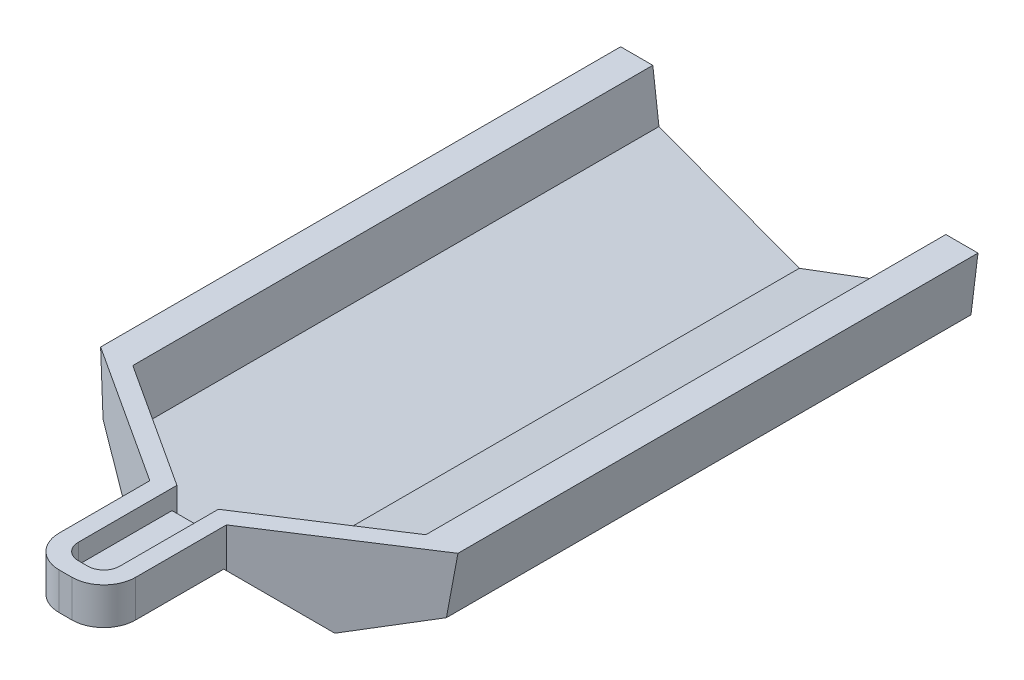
ISO-10303-21;
HEADER;
FILE_DESCRIPTION(('STEP AP214'),'2;1');
FILE_NAME('part.step','',(''),(''),'','','');
FILE_SCHEMA(('AUTOMOTIVE_DESIGN { 1 0 10303 214 1 1 1 1 }'));
ENDSEC;
DATA;
#1=APPLICATION_CONTEXT('core data for automotive mechanical design processes');
#2=APPLICATION_PROTOCOL_DEFINITION('international standard','automotive_design',2000,#1);
#3=PRODUCT_CONTEXT('',#1,'mechanical');
#4=PRODUCT('Part','Part','',(#3));
#5=PRODUCT_RELATED_PRODUCT_CATEGORY('part','',(#4));
#6=PRODUCT_DEFINITION_FORMATION('','',#4);
#7=PRODUCT_DEFINITION_CONTEXT('part definition',#1,'design');
#8=PRODUCT_DEFINITION('design','',#6,#7);
#9=PRODUCT_DEFINITION_SHAPE('','',#8);
#10=(LENGTH_UNIT() NAMED_UNIT(*) SI_UNIT(.MILLI.,.METRE.));
#11=(NAMED_UNIT(*) PLANE_ANGLE_UNIT() SI_UNIT($,.RADIAN.));
#12=(NAMED_UNIT(*) SI_UNIT($,.STERADIAN.) SOLID_ANGLE_UNIT());
#13=UNCERTAINTY_MEASURE_WITH_UNIT(LENGTH_MEASURE(1.E-05),#10,'distance_accuracy_value','');
#14=(GEOMETRIC_REPRESENTATION_CONTEXT(3) GLOBAL_UNCERTAINTY_ASSIGNED_CONTEXT((#13)) GLOBAL_UNIT_ASSIGNED_CONTEXT((#10,
#11,#12)) REPRESENTATION_CONTEXT('',''));
#15=CARTESIAN_POINT('',(0.,0.,0.));
#16=DIRECTION('',(0.,0.,1.));
#17=DIRECTION('',(1.,0.,0.));
#18=AXIS2_PLACEMENT_3D('',#15,#16,#17);
#19=CARTESIAN_POINT('',(-53.8063518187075,20.1341692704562,230.));
#20=DIRECTION('',(0.992546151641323,0.121869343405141,0.));
#21=DIRECTION('',(-0.121869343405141,0.992546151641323,0.));
#22=AXIS2_PLACEMENT_3D('',#19,#20,#21);
#23=PLANE('',#22);
#24=DIRECTION('',(0.,0.,-1.));
#25=VECTOR('',#24,1.);
#26=CARTESIAN_POINT('',(-53.8063518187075,20.1341692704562,230.));
#27=LINE('',#26,#25);
#28=CARTESIAN_POINT('',(-53.8063518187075,20.1341692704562,164.424571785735));
#29=VERTEX_POINT('',#28);
#30=CARTESIAN_POINT('',(-53.8063518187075,20.1341692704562,0.));
#31=VERTEX_POINT('',#30);
#32=EDGE_CURVE('E367',#29,#31,#27,.T.);
#33=ORIENTED_EDGE('',*,*,#32,.F.);
#34=DIRECTION('',(-0.121489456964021,0.989452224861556,-0.0788961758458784));
#35=VECTOR('',#34,1.);
#36=CARTESIAN_POINT('',(-53.1778078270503,15.0150892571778,164.832753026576));
#37=LINE('',#36,#35);
#38=CARTESIAN_POINT('',(-56.,38.,163.));
#39=VERTEX_POINT('',#38);
#40=EDGE_CURVE('E338',#29,#39,#37,.T.);
#41=ORIENTED_EDGE('',*,*,#40,.T.);
#42=DIRECTION('',(0.,0.,-1.));
#43=VECTOR('',#42,1.);
#44=CARTESIAN_POINT('',(-56.,38.,230.));
#45=LINE('',#44,#43);
#46=CARTESIAN_POINT('',(-56.,38.,0.));
#47=VERTEX_POINT('',#46);
#48=EDGE_CURVE('E358',#39,#47,#45,.T.);
#49=ORIENTED_EDGE('',*,*,#48,.T.);
#50=DIRECTION('',(0.121869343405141,-0.992546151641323,0.));
#51=VECTOR('',#50,1.);
#52=CARTESIAN_POINT('',(-53.8063518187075,20.1341692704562,0.));
#53=LINE('',#52,#51);
#54=EDGE_CURVE('E341',#47,#31,#53,.T.);
#55=ORIENTED_EDGE('',*,*,#54,.T.);
#56=EDGE_LOOP('',(#33,#41,#49,#55));
#57=FACE_BOUND('',#56,.T.);
#58=ADVANCED_FACE('F31',(#57),#23,.F.);
#59=CARTESIAN_POINT('',(0.,0.,230.));
#60=DIRECTION('',(0.350463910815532,0.936576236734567,0.));
#61=DIRECTION('',(-0.936576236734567,0.350463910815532,0.));
#62=AXIS2_PLACEMENT_3D('',#59,#60,#61);
#63=PLANE('',#62);
#64=DIRECTION('',(0.,0.,-1.));
#65=VECTOR('',#64,1.);
#66=CARTESIAN_POINT('',(0.,0.,230.));
#67=LINE('',#66,#65);
#68=CARTESIAN_POINT('',(0.,0.,166.));
#69=VERTEX_POINT('',#68);
#70=CARTESIAN_POINT('',(0.,0.,0.));
#71=VERTEX_POINT('',#70);
#72=EDGE_CURVE('E365',#69,#71,#67,.T.);
#73=ORIENTED_EDGE('',*,*,#72,.F.);
#74=DIRECTION('',(-0.88386738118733,0.330740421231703,0.330740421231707));
#75=VECTOR('',#74,1.);
#76=CARTESIAN_POINT('',(-18.7091628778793,7.00091047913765,173.000910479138));
#77=LINE('',#76,#75);
#78=CARTESIAN_POINT('',(-32.5973810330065,12.1978384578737,178.197838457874));
#79=VERTEX_POINT('',#78);
#80=EDGE_CURVE('E303',#69,#79,#77,.T.);
#81=ORIENTED_EDGE('',*,*,#80,.T.);
#82=DIRECTION('',(-0.800191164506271,0.299429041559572,-0.519650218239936));
#83=VECTOR('',#82,1.);
#84=CARTESIAN_POINT('',(12.7378718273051,-4.76647196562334,207.63889590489));
#85=LINE('',#84,#83);
#86=EDGE_CURVE('E336',#79,#29,#85,.T.);
#87=ORIENTED_EDGE('',*,*,#86,.T.);
#88=ORIENTED_EDGE('',*,*,#32,.T.);
#89=DIRECTION('',(0.936576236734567,-0.350463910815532,0.));
#90=VECTOR('',#89,1.);
#91=CARTESIAN_POINT('',(0.,0.,0.));
#92=LINE('',#91,#90);
#93=EDGE_CURVE('E344',#31,#71,#92,.T.);
#94=ORIENTED_EDGE('',*,*,#93,.T.);
#95=EDGE_LOOP('',(#73,#81,#87,#88,#94));
#96=FACE_BOUND('',#95,.T.);
#97=ADVANCED_FACE('F428',(#96),#63,.F.);
#98=CARTESIAN_POINT('',(0.,0.,230.));
#99=DIRECTION('',(-0.350463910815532,0.936576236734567,0.));
#100=DIRECTION('',(-0.936576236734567,-0.350463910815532,0.));
#101=AXIS2_PLACEMENT_3D('',#98,#99,#100);
#102=PLANE('',#101);
#103=DIRECTION('',(-0.800191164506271,-0.299429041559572,0.519650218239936));
#104=VECTOR('',#103,1.);
#105=CARTESIAN_POINT('',(-12.7378718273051,-4.76647196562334,207.63889590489));
#106=LINE('',#105,#104);
#107=CARTESIAN_POINT('',(53.8063518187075,20.1341692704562,164.424571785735));
#108=VERTEX_POINT('',#107);
#109=CARTESIAN_POINT('',(32.5973810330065,12.1978384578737,178.197838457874));
#110=VERTEX_POINT('',#109);
#111=EDGE_CURVE('E326',#108,#110,#106,.T.);
#112=ORIENTED_EDGE('',*,*,#111,.T.);
#113=DIRECTION('',(-0.88386738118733,-0.330740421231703,-0.330740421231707));
#114=VECTOR('',#113,1.);
#115=CARTESIAN_POINT('',(18.7091628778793,7.00091047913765,173.000910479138));
#116=LINE('',#115,#114);
#117=EDGE_CURVE('E300',#110,#69,#116,.T.);
#118=ORIENTED_EDGE('',*,*,#117,.T.);
#119=ORIENTED_EDGE('',*,*,#72,.T.);
#120=DIRECTION('',(0.936576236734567,0.350463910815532,0.));
#121=VECTOR('',#120,1.);
#122=CARTESIAN_POINT('',(0.,0.,0.));
#123=LINE('',#122,#121);
#124=CARTESIAN_POINT('',(53.8063518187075,20.1341692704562,0.));
#125=VERTEX_POINT('',#124);
#126=EDGE_CURVE('E347',#71,#125,#123,.T.);
#127=ORIENTED_EDGE('',*,*,#126,.T.);
#128=DIRECTION('',(0.,0.,-1.));
#129=VECTOR('',#128,1.);
#130=CARTESIAN_POINT('',(53.8063518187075,20.1341692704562,230.));
#131=LINE('',#130,#129);
#132=EDGE_CURVE('E363',#108,#125,#131,.T.);
#133=ORIENTED_EDGE('',*,*,#132,.F.);
#134=EDGE_LOOP('',(#112,#118,#119,#127,#133));
#135=FACE_BOUND('',#134,.T.);
#136=ADVANCED_FACE('F433',(#135),#102,.F.);
#137=CARTESIAN_POINT('',(53.8063518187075,20.1341692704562,230.));
#138=DIRECTION('',(-0.992546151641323,0.121869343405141,0.));
#139=DIRECTION('',(-0.121869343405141,-0.992546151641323,0.));
#140=AXIS2_PLACEMENT_3D('',#137,#138,#139);
#141=PLANE('',#140);
#142=DIRECTION('',(0.,0.,-1.));
#143=VECTOR('',#142,1.);
#144=CARTESIAN_POINT('',(56.,38.,230.));
#145=LINE('',#144,#143);
#146=CARTESIAN_POINT('',(56.,38.,163.));
#147=VERTEX_POINT('',#146);
#148=CARTESIAN_POINT('',(56.,38.,0.));
#149=VERTEX_POINT('',#148);
#150=EDGE_CURVE('E361',#147,#149,#145,.T.);
#151=ORIENTED_EDGE('',*,*,#150,.F.);
#152=DIRECTION('',(-0.121489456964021,-0.989452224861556,0.0788961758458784));
#153=VECTOR('',#152,1.);
#154=CARTESIAN_POINT('',(53.1778078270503,15.0150892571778,164.832753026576));
#155=LINE('',#154,#153);
#156=EDGE_CURVE('E323',#147,#108,#155,.T.);
#157=ORIENTED_EDGE('',*,*,#156,.T.);
#158=ORIENTED_EDGE('',*,*,#132,.T.);
#159=DIRECTION('',(0.121869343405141,0.992546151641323,0.));
#160=VECTOR('',#159,1.);
#161=CARTESIAN_POINT('',(53.8063518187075,20.1341692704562,0.));
#162=LINE('',#161,#160);
#163=EDGE_CURVE('E350',#125,#149,#162,.T.);
#164=ORIENTED_EDGE('',*,*,#163,.T.);
#165=EDGE_LOOP('',(#151,#157,#158,#164));
#166=FACE_BOUND('',#165,.T.);
#167=ADVANCED_FACE('F474',(#166),#141,.F.);
#168=CARTESIAN_POINT('',(56.,38.,230.));
#169=DIRECTION('',(0.,-1.,0.));
#170=DIRECTION('',(0.,0.,-1.));
#171=AXIS2_PLACEMENT_3D('',#168,#169,#170);
#172=PLANE('',#171);
#173=DIRECTION('',(0.,0.,-1.));
#174=VECTOR('',#173,1.);
#175=CARTESIAN_POINT('',(-45.9249017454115,38.,230.));
#176=LINE('',#175,#174);
#177=CARTESIAN_POINT('',(-45.9249017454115,38.,162.984847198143));
#178=VERTEX_POINT('',#177);
#179=CARTESIAN_POINT('',(-45.9249017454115,38.,0.));
#180=VERTEX_POINT('',#179);
#181=EDGE_CURVE('E281',#178,#180,#176,.T.);
#182=ORIENTED_EDGE('',*,*,#181,.T.);
#183=DIRECTION('',(-1.,0.,0.));
#184=VECTOR('',#183,1.);
#185=CARTESIAN_POINT('',(56.,38.,0.));
#186=LINE('',#185,#184);
#187=EDGE_CURVE('E353',#180,#47,#186,.T.);
#188=ORIENTED_EDGE('',*,*,#187,.T.);
#189=ORIENTED_EDGE('',*,*,#48,.F.);
#190=DIRECTION('',(-0.838670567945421,0.,-0.544639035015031));
#191=VECTOR('',#190,1.);
#192=CARTESIAN_POINT('',(-12.,38.,191.573934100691));
#193=LINE('',#192,#191);
#194=CARTESIAN_POINT('',(-12.,38.,191.573934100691));
#195=VERTEX_POINT('',#194);
#196=EDGE_CURVE('E331',#195,#39,#193,.T.);
#197=ORIENTED_EDGE('',*,*,#196,.F.);
#198=DIRECTION('',(0.,0.,-1.));
#199=VECTOR('',#198,1.);
#200=CARTESIAN_POINT('',(-12.,38.,230.));
#201=LINE('',#200,#199);
#202=CARTESIAN_POINT('',(-12.,38.,220.));
#203=VERTEX_POINT('',#202);
#204=EDGE_CURVE('E329',#203,#195,#201,.T.);
#205=ORIENTED_EDGE('',*,*,#204,.F.);
#206=CARTESIAN_POINT('',(-2.,38.,220.));
#207=DIRECTION('',(0.,-1.,0.));
#208=DIRECTION('',(0.,0.,-1.));
#209=AXIS2_PLACEMENT_3D('',#206,#207,#208);
#210=CIRCLE('',#209,10.);
#211=CARTESIAN_POINT('',(-2.,38.,230.));
#212=VERTEX_POINT('',#211);
#213=EDGE_CURVE('E377',#203,#212,#210,.F.);
#214=ORIENTED_EDGE('',*,*,#213,.T.);
#215=DIRECTION('',(-1.,0.,0.));
#216=VECTOR('',#215,1.);
#217=CARTESIAN_POINT('',(56.,38.,230.));
#218=LINE('',#217,#216);
#219=CARTESIAN_POINT('',(2.,38.,230.));
#220=VERTEX_POINT('',#219);
#221=EDGE_CURVE('E356',#220,#212,#218,.T.);
#222=ORIENTED_EDGE('',*,*,#221,.F.);
#223=CARTESIAN_POINT('',(2.,38.,220.));
#224=DIRECTION('',(0.,-1.,0.));
#225=DIRECTION('',(0.,0.,-1.));
#226=AXIS2_PLACEMENT_3D('',#223,#224,#225);
#227=CIRCLE('',#226,10.);
#228=CARTESIAN_POINT('',(12.,38.,220.));
#229=VERTEX_POINT('',#228);
#230=EDGE_CURVE('E391',#220,#229,#227,.F.);
#231=ORIENTED_EDGE('',*,*,#230,.T.);
#232=DIRECTION('',(0.,0.,1.));
#233=VECTOR('',#232,1.);
#234=CARTESIAN_POINT('',(12.,38.,230.));
#235=LINE('',#234,#233);
#236=CARTESIAN_POINT('',(12.,38.,191.573934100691));
#237=VERTEX_POINT('',#236);
#238=EDGE_CURVE('E318',#237,#229,#235,.T.);
#239=ORIENTED_EDGE('',*,*,#238,.F.);
#240=DIRECTION('',(-0.838670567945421,0.,0.544639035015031));
#241=VECTOR('',#240,1.);
#242=CARTESIAN_POINT('',(12.,38.,191.573934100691));
#243=LINE('',#242,#241);
#244=EDGE_CURVE('E315',#147,#237,#243,.T.);
#245=ORIENTED_EDGE('',*,*,#244,.F.);
#246=ORIENTED_EDGE('',*,*,#150,.T.);
#247=CARTESIAN_POINT('',(45.9249017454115,38.,0.));
#248=VERTEX_POINT('',#247);
#249=EDGE_CURVE('E354',#149,#248,#186,.T.);
#250=ORIENTED_EDGE('',*,*,#249,.T.);
#251=DIRECTION('',(0.,0.,-1.));
#252=VECTOR('',#251,1.);
#253=CARTESIAN_POINT('',(45.9249017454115,38.,230.));
#254=LINE('',#253,#252);
#255=CARTESIAN_POINT('',(45.9249017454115,38.,162.984847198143));
#256=VERTEX_POINT('',#255);
#257=EDGE_CURVE('E213',#256,#248,#254,.T.);
#258=ORIENTED_EDGE('',*,*,#257,.F.);
#259=DIRECTION('',(-0.838670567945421,0.,0.544639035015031));
#260=VECTOR('',#259,1.);
#261=CARTESIAN_POINT('',(9.00448530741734,38.,186.961245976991));
#262=LINE('',#261,#260);
#263=CARTESIAN_POINT('',(6.50000000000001,38.,188.587677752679));
#264=VERTEX_POINT('',#263);
#265=EDGE_CURVE('E273',#256,#264,#262,.T.);
#266=ORIENTED_EDGE('',*,*,#265,.T.);
#267=DIRECTION('',(0.,0.,1.));
#268=VECTOR('',#267,1.);
#269=CARTESIAN_POINT('',(6.5,38.,230.));
#270=LINE('',#269,#268);
#271=CARTESIAN_POINT('',(6.5,38.,219.5));
#272=VERTEX_POINT('',#271);
#273=EDGE_CURVE('E260',#264,#272,#270,.T.);
#274=ORIENTED_EDGE('',*,*,#273,.T.);
#275=CARTESIAN_POINT('',(1.49999999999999,38.,219.5));
#276=DIRECTION('',(0.,-1.,0.));
#277=DIRECTION('',(0.,0.,-1.));
#278=AXIS2_PLACEMENT_3D('',#275,#276,#277);
#279=CIRCLE('',#278,5.);
#280=CARTESIAN_POINT('',(1.49999999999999,38.,224.5));
#281=VERTEX_POINT('',#280);
#282=EDGE_CURVE('E400',#272,#281,#279,.T.);
#283=ORIENTED_EDGE('',*,*,#282,.T.);
#284=DIRECTION('',(-1.,0.,0.));
#285=VECTOR('',#284,1.);
#286=CARTESIAN_POINT('',(56.,38.,224.5));
#287=LINE('',#286,#285);
#288=CARTESIAN_POINT('',(-1.49999999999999,38.,224.5));
#289=VERTEX_POINT('',#288);
#290=EDGE_CURVE('E241',#281,#289,#287,.T.);
#291=ORIENTED_EDGE('',*,*,#290,.T.);
#292=CARTESIAN_POINT('',(-1.49999999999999,38.,219.5));
#293=DIRECTION('',(0.,-1.,0.));
#294=DIRECTION('',(0.,0.,-1.));
#295=AXIS2_PLACEMENT_3D('',#292,#293,#294);
#296=CIRCLE('',#295,5.);
#297=CARTESIAN_POINT('',(-6.5,38.,219.5));
#298=VERTEX_POINT('',#297);
#299=EDGE_CURVE('E11',#289,#298,#296,.T.);
#300=ORIENTED_EDGE('',*,*,#299,.T.);
#301=DIRECTION('',(0.,0.,-1.));
#302=VECTOR('',#301,1.);
#303=CARTESIAN_POINT('',(-6.5,38.,230.));
#304=LINE('',#303,#302);
#305=CARTESIAN_POINT('',(-6.50000000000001,38.,188.587677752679));
#306=VERTEX_POINT('',#305);
#307=EDGE_CURVE('E252',#298,#306,#304,.T.);
#308=ORIENTED_EDGE('',*,*,#307,.T.);
#309=DIRECTION('',(-0.838670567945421,0.,-0.544639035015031));
#310=VECTOR('',#309,1.);
#311=CARTESIAN_POINT('',(-9.00448530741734,38.,186.961245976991));
#312=LINE('',#311,#310);
#313=EDGE_CURVE('E276',#306,#178,#312,.T.);
#314=ORIENTED_EDGE('',*,*,#313,.T.);
#315=EDGE_LOOP('',(#182,#188,#189,#197,#205,#214,#222,#231,#239,#245,#246,#250,#258,#266,#274,
#283,#291,#300,#308,#314));
#316=FACE_BOUND('',#315,.T.);
#317=ADVANCED_FACE('F452',(#316),#172,.F.);
#318=CARTESIAN_POINT('',(-56.,38.,230.));
#319=DIRECTION('',(0.,0.,1.));
#320=DIRECTION('',(1.,0.,0.));
#321=AXIS2_PLACEMENT_3D('',#318,#319,#320);
#322=PLANE('',#321);
#323=DIRECTION('',(1.,0.,0.));
#324=VECTOR('',#323,1.);
#325=CARTESIAN_POINT('',(-50.,26.39701808,230.));
#326=LINE('',#325,#324);
#327=CARTESIAN_POINT('',(-2.,26.39701808,230.));
#328=VERTEX_POINT('',#327);
#329=CARTESIAN_POINT('',(2.,26.39701808,230.));
#330=VERTEX_POINT('',#329);
#331=EDGE_CURVE('E265',#328,#330,#326,.T.);
#332=ORIENTED_EDGE('',*,*,#331,.T.);
#333=DIRECTION('',(0.,-1.,0.));
#334=VECTOR('',#333,1.);
#335=CARTESIAN_POINT('',(2.,38.,230.));
#336=LINE('',#335,#334);
#337=EDGE_CURVE('E389',#330,#220,#336,.F.);
#338=ORIENTED_EDGE('',*,*,#337,.T.);
#339=ORIENTED_EDGE('',*,*,#221,.T.);
#340=DIRECTION('',(0.,1.,0.));
#341=VECTOR('',#340,1.);
#342=CARTESIAN_POINT('',(-2.,26.39701808,230.));
#343=LINE('',#342,#341);
#344=EDGE_CURVE('E380',#212,#328,#343,.F.);
#345=ORIENTED_EDGE('',*,*,#344,.T.);
#346=EDGE_LOOP('',(#332,#338,#339,#345));
#347=FACE_BOUND('',#346,.T.);
#348=ADVANCED_FACE('F500',(#347),#322,.T.);
#349=CARTESIAN_POINT('',(-56.,38.,0.));
#350=DIRECTION('',(0.,0.,1.));
#351=DIRECTION('',(1.,0.,0.));
#352=AXIS2_PLACEMENT_3D('',#349,#350,#351);
#353=PLANE('',#352);
#354=ORIENTED_EDGE('',*,*,#187,.F.);
#355=DIRECTION('',(0.121869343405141,-0.992546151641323,0.));
#356=VECTOR('',#355,1.);
#357=CARTESIAN_POINT('',(-46.0745384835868,39.2186934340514,0.));
#358=LINE('',#357,#356);
#359=CARTESIAN_POINT('',(-44.0018252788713,22.3377990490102,0.));
#360=VERTEX_POINT('',#359);
#361=EDGE_CURVE('E222',#180,#360,#358,.T.);
#362=ORIENTED_EDGE('',*,*,#361,.T.);
#363=DIRECTION('',(0.936576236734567,-0.350463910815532,0.));
#364=VECTOR('',#363,1.);
#365=CARTESIAN_POINT('',(-59.6672256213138,28.1997430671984,0.));
#366=LINE('',#365,#364);
#367=CARTESIAN_POINT('',(0.,5.87245307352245,0.));
#368=VERTEX_POINT('',#367);
#369=EDGE_CURVE('E228',#360,#368,#366,.T.);
#370=ORIENTED_EDGE('',*,*,#369,.T.);
#371=DIRECTION('',(0.936576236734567,0.350463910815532,0.));
#372=VECTOR('',#371,1.);
#373=CARTESIAN_POINT('',(-38.5763796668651,-8.56270805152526,0.));
#374=LINE('',#373,#372);
#375=CARTESIAN_POINT('',(44.0018252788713,22.3377990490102,0.));
#376=VERTEX_POINT('',#375);
#377=EDGE_CURVE('E206',#368,#376,#374,.T.);
#378=ORIENTED_EDGE('',*,*,#377,.T.);
#379=DIRECTION('',(0.121869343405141,0.992546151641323,0.));
#380=VECTOR('',#379,1.);
#381=CARTESIAN_POINT('',(44.4110991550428,25.6710672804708,0.));
#382=LINE('',#381,#380);
#383=EDGE_CURVE('E216',#376,#248,#382,.T.);
#384=ORIENTED_EDGE('',*,*,#383,.T.);
#385=ORIENTED_EDGE('',*,*,#249,.F.);
#386=ORIENTED_EDGE('',*,*,#163,.F.);
#387=ORIENTED_EDGE('',*,*,#126,.F.);
#388=ORIENTED_EDGE('',*,*,#93,.F.);
#389=ORIENTED_EDGE('',*,*,#54,.F.);
#390=EDGE_LOOP('',(#354,#362,#370,#378,#384,#385,#386,#387,#388,#389));
#391=FACE_BOUND('',#390,.T.);
#392=ADVANCED_FACE('F225',(#391),#353,.F.);
#393=CARTESIAN_POINT('',(-12.,0.,191.573934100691));
#394=DIRECTION('',(0.544639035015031,0.,-0.838670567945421));
#395=DIRECTION('',(-0.838670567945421,0.,-0.544639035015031));
#396=AXIS2_PLACEMENT_3D('',#393,#394,#395);
#397=PLANE('',#396);
#398=ORIENTED_EDGE('',*,*,#86,.F.);
#399=DIRECTION('',(0.73651753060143,0.478300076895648,0.478300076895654));
#400=VECTOR('',#399,1.);
#401=CARTESIAN_POINT('',(-21.0090932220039,19.7233605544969,185.723360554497));
#402=LINE('',#401,#400);
#403=CARTESIAN_POINT('',(-12.,25.5739341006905,191.573934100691));
#404=VERTEX_POINT('',#403);
#405=EDGE_CURVE('E306',#79,#404,#402,.T.);
#406=ORIENTED_EDGE('',*,*,#405,.T.);
#407=DIRECTION('',(0.,1.,0.));
#408=VECTOR('',#407,1.);
#409=CARTESIAN_POINT('',(-12.,0.,191.573934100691));
#410=LINE('',#409,#408);
#411=EDGE_CURVE('E333',#404,#195,#410,.T.);
#412=ORIENTED_EDGE('',*,*,#411,.T.);
#413=ORIENTED_EDGE('',*,*,#196,.T.);
#414=ORIENTED_EDGE('',*,*,#40,.F.);
#415=EDGE_LOOP('',(#398,#406,#412,#413,#414));
#416=FACE_BOUND('',#415,.T.);
#417=ADVANCED_FACE('F448',(#416),#397,.F.);
#418=CARTESIAN_POINT('',(-12.,0.,230.));
#419=DIRECTION('',(1.,0.,0.));
#420=DIRECTION('',(0.,0.,-1.));
#421=AXIS2_PLACEMENT_3D('',#418,#419,#420);
#422=PLANE('',#421);
#423=DIRECTION('',(0.,0.,1.));
#424=VECTOR('',#423,1.);
#425=CARTESIAN_POINT('',(-12.,26.39701808,230.));
#426=LINE('',#425,#424);
#427=CARTESIAN_POINT('',(-12.,26.39701808,192.39701808));
#428=VERTEX_POINT('',#427);
#429=CARTESIAN_POINT('',(-12.,26.39701808,220.));
#430=VERTEX_POINT('',#429);
#431=EDGE_CURVE('E312',#428,#430,#426,.T.);
#432=ORIENTED_EDGE('',*,*,#431,.T.);
#433=DIRECTION('',(0.,1.,0.));
#434=VECTOR('',#433,1.);
#435=CARTESIAN_POINT('',(-12.,38.,220.));
#436=LINE('',#435,#434);
#437=EDGE_CURVE('E374',#430,#203,#436,.T.);
#438=ORIENTED_EDGE('',*,*,#437,.T.);
#439=ORIENTED_EDGE('',*,*,#204,.T.);
#440=ORIENTED_EDGE('',*,*,#411,.F.);
#441=DIRECTION('',(0.,0.707106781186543,0.707106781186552));
#442=VECTOR('',#441,1.);
#443=CARTESIAN_POINT('',(-12.,32.,198.));
#444=LINE('',#443,#442);
#445=EDGE_CURVE('E309',#404,#428,#444,.T.);
#446=ORIENTED_EDGE('',*,*,#445,.T.);
#447=EDGE_LOOP('',(#432,#438,#439,#440,#446));
#448=FACE_BOUND('',#447,.T.);
#449=ADVANCED_FACE('F489',(#448),#422,.F.);
#450=CARTESIAN_POINT('',(12.,0.,191.573934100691));
#451=DIRECTION('',(-0.544639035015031,0.,-0.838670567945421));
#452=DIRECTION('',(-0.838670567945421,0.,0.544639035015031));
#453=AXIS2_PLACEMENT_3D('',#450,#451,#452);
#454=PLANE('',#453);
#455=DIRECTION('',(0.,1.,0.));
#456=VECTOR('',#455,1.);
#457=CARTESIAN_POINT('',(12.,0.,191.573934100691));
#458=LINE('',#457,#456);
#459=CARTESIAN_POINT('',(12.,25.5739341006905,191.573934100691));
#460=VERTEX_POINT('',#459);
#461=EDGE_CURVE('E321',#460,#237,#458,.T.);
#462=ORIENTED_EDGE('',*,*,#461,.F.);
#463=DIRECTION('',(0.73651753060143,-0.478300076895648,-0.478300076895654));
#464=VECTOR('',#463,1.);
#465=CARTESIAN_POINT('',(21.0090932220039,19.7233605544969,185.723360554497));
#466=LINE('',#465,#464);
#467=EDGE_CURVE('E295',#460,#110,#466,.T.);
#468=ORIENTED_EDGE('',*,*,#467,.T.);
#469=ORIENTED_EDGE('',*,*,#111,.F.);
#470=ORIENTED_EDGE('',*,*,#156,.F.);
#471=ORIENTED_EDGE('',*,*,#244,.T.);
#472=EDGE_LOOP('',(#462,#468,#469,#470,#471));
#473=FACE_BOUND('',#472,.T.);
#474=ADVANCED_FACE('F477',(#473),#454,.F.);
#475=CARTESIAN_POINT('',(12.,0.,230.));
#476=DIRECTION('',(-1.,0.,0.));
#477=DIRECTION('',(0.,0.,1.));
#478=AXIS2_PLACEMENT_3D('',#475,#476,#477);
#479=PLANE('',#478);
#480=ORIENTED_EDGE('',*,*,#238,.T.);
#481=DIRECTION('',(0.,-1.,0.));
#482=VECTOR('',#481,1.);
#483=CARTESIAN_POINT('',(12.,26.39701808,220.));
#484=LINE('',#483,#482);
#485=CARTESIAN_POINT('',(12.,26.39701808,220.));
#486=VERTEX_POINT('',#485);
#487=EDGE_CURVE('E384',#229,#486,#484,.T.);
#488=ORIENTED_EDGE('',*,*,#487,.T.);
#489=DIRECTION('',(0.,0.,-1.));
#490=VECTOR('',#489,1.);
#491=CARTESIAN_POINT('',(12.,26.39701808,230.));
#492=LINE('',#491,#490);
#493=CARTESIAN_POINT('',(12.,26.39701808,192.39701808));
#494=VERTEX_POINT('',#493);
#495=EDGE_CURVE('E372',#486,#494,#492,.T.);
#496=ORIENTED_EDGE('',*,*,#495,.T.);
#497=DIRECTION('',(0.,-0.707106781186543,-0.707106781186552));
#498=VECTOR('',#497,1.);
#499=CARTESIAN_POINT('',(12.,32.,198.));
#500=LINE('',#499,#498);
#501=EDGE_CURVE('E369',#494,#460,#500,.T.);
#502=ORIENTED_EDGE('',*,*,#501,.T.);
#503=ORIENTED_EDGE('',*,*,#461,.T.);
#504=EDGE_LOOP('',(#480,#488,#496,#502,#503));
#505=FACE_BOUND('',#504,.T.);
#506=ADVANCED_FACE('F482',(#505),#479,.F.);
#507=CARTESIAN_POINT('',(-50.,26.39701808,230.));
#508=DIRECTION('',(0.,1.,0.));
#509=DIRECTION('',(0.,0.,1.));
#510=AXIS2_PLACEMENT_3D('',#507,#508,#509);
#511=PLANE('',#510);
#512=ORIENTED_EDGE('',*,*,#495,.F.);
#513=CARTESIAN_POINT('',(2.,26.39701808,220.));
#514=DIRECTION('',(0.,1.,0.));
#515=DIRECTION('',(0.,0.,1.));
#516=AXIS2_PLACEMENT_3D('',#513,#514,#515);
#517=CIRCLE('',#516,10.);
#518=EDGE_CURVE('E387',#486,#330,#517,.F.);
#519=ORIENTED_EDGE('',*,*,#518,.T.);
#520=ORIENTED_EDGE('',*,*,#331,.F.);
#521=CARTESIAN_POINT('',(-2.,26.39701808,220.));
#522=DIRECTION('',(0.,1.,0.));
#523=DIRECTION('',(0.,0.,1.));
#524=AXIS2_PLACEMENT_3D('',#521,#522,#523);
#525=CIRCLE('',#524,10.);
#526=EDGE_CURVE('E382',#328,#430,#525,.F.);
#527=ORIENTED_EDGE('',*,*,#526,.T.);
#528=ORIENTED_EDGE('',*,*,#431,.F.);
#529=DIRECTION('',(1.,0.,0.));
#530=VECTOR('',#529,1.);
#531=CARTESIAN_POINT('',(-50.,26.39701808,192.39701808));
#532=LINE('',#531,#530);
#533=EDGE_CURVE('E292',#428,#494,#532,.T.);
#534=ORIENTED_EDGE('',*,*,#533,.T.);
#535=EDGE_LOOP('',(#512,#519,#520,#527,#528,#534));
#536=FACE_BOUND('',#535,.T.);
#537=ADVANCED_FACE('F486',(#536),#511,.F.);
#538=CARTESIAN_POINT('',(-50.,26.39701808,192.39701808));
#539=DIRECTION('',(0.,0.707106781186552,-0.707106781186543));
#540=DIRECTION('',(0.,0.707106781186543,0.707106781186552));
#541=AXIS2_PLACEMENT_3D('',#538,#539,#540);
#542=PLANE('',#541);
#543=ORIENTED_EDGE('',*,*,#405,.F.);
#544=ORIENTED_EDGE('',*,*,#80,.F.);
#545=ORIENTED_EDGE('',*,*,#117,.F.);
#546=ORIENTED_EDGE('',*,*,#467,.F.);
#547=ORIENTED_EDGE('',*,*,#501,.F.);
#548=ORIENTED_EDGE('',*,*,#533,.F.);
#549=ORIENTED_EDGE('',*,*,#445,.F.);
#550=EDGE_LOOP('',(#543,#544,#545,#546,#547,#548,#549));
#551=FACE_BOUND('',#550,.T.);
#552=ADVANCED_FACE('F479',(#551),#542,.F.);
#553=CARTESIAN_POINT('',(-43.8808903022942,21.3528627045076,230.));
#554=DIRECTION('',(0.992546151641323,0.121869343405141,0.));
#555=DIRECTION('',(-0.121869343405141,0.992546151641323,0.));
#556=AXIS2_PLACEMENT_3D('',#553,#554,#555);
#557=PLANE('',#556);
#558=DIRECTION('',(0.,0.,-1.));
#559=VECTOR('',#558,1.);
#560=CARTESIAN_POINT('',(-44.0018252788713,22.3377990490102,230.));
#561=LINE('',#560,#559);
#562=CARTESIAN_POINT('',(-44.0018252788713,22.3377990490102,164.233707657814));
#563=VERTEX_POINT('',#562);
#564=EDGE_CURVE('E236',#563,#360,#561,.T.);
#565=ORIENTED_EDGE('',*,*,#564,.T.);
#566=ORIENTED_EDGE('',*,*,#361,.F.);
#567=ORIENTED_EDGE('',*,*,#181,.F.);
#568=DIRECTION('',(-0.121489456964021,0.989452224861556,-0.0788961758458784));
#569=VECTOR('',#568,1.);
#570=CARTESIAN_POINT('',(-43.2512696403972,16.2250139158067,164.721124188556));
#571=LINE('',#570,#569);
#572=EDGE_CURVE('E239',#563,#178,#571,.T.);
#573=ORIENTED_EDGE('',*,*,#572,.F.);
#574=EDGE_LOOP('',(#565,#566,#567,#573));
#575=FACE_BOUND('',#574,.T.);
#576=ADVANCED_FACE('F456',(#575),#557,.T.);
#577=CARTESIAN_POINT('',(1.92755150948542,5.15116930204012,230.));
#578=DIRECTION('',(0.350463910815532,0.936576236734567,0.));
#579=DIRECTION('',(-0.936576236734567,0.350463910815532,0.));
#580=AXIS2_PLACEMENT_3D('',#577,#578,#579);
#581=PLANE('',#580);
#582=DIRECTION('',(0.,0.,-1.));
#583=VECTOR('',#582,1.);
#584=CARTESIAN_POINT('',(0.,5.87245307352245,230.));
#585=LINE('',#584,#583);
#586=CARTESIAN_POINT('',(0.,5.87245307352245,164.09427848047));
#587=VERTEX_POINT('',#586);
#588=EDGE_CURVE('E212',#587,#368,#585,.T.);
#589=ORIENTED_EDGE('',*,*,#588,.T.);
#590=ORIENTED_EDGE('',*,*,#369,.F.);
#591=ORIENTED_EDGE('',*,*,#564,.F.);
#592=DIRECTION('',(-0.800191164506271,0.299429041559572,-0.519650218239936));
#593=VECTOR('',#592,1.);
#594=CARTESIAN_POINT('',(16.871857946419,-0.440943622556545,203.765539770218));
#595=LINE('',#594,#593);
#596=CARTESIAN_POINT('',(-28.0523866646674,16.3695687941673,174.591394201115));
#597=VERTEX_POINT('',#596);
#598=EDGE_CURVE('E242',#597,#563,#595,.T.);
#599=ORIENTED_EDGE('',*,*,#598,.F.);
#600=DIRECTION('',(-0.88386738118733,0.330740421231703,0.330740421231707));
#601=VECTOR('',#600,1.);
#602=CARTESIAN_POINT('',(-17.5495655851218,12.4394458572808,170.661271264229));
#603=LINE('',#602,#601);
#604=EDGE_CURVE('E244',#587,#597,#603,.T.);
#605=ORIENTED_EDGE('',*,*,#604,.F.);
#606=EDGE_LOOP('',(#589,#590,#591,#599,#605));
#607=FACE_BOUND('',#606,.T.);
#608=ADVANCED_FACE('F461',(#607),#581,.T.);
#609=CARTESIAN_POINT('',(-1.92755150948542,5.15116930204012,230.));
#610=DIRECTION('',(-0.350463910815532,0.936576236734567,0.));
#611=DIRECTION('',(-0.936576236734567,-0.350463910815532,0.));
#612=AXIS2_PLACEMENT_3D('',#609,#610,#611);
#613=PLANE('',#612);
#614=DIRECTION('',(-0.800191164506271,-0.299429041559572,0.519650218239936));
#615=VECTOR('',#614,1.);
#616=CARTESIAN_POINT('',(-16.871857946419,-0.440943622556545,203.765539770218));
#617=LINE('',#616,#615);
#618=CARTESIAN_POINT('',(44.0018252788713,22.3377990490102,164.233707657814));
#619=VERTEX_POINT('',#618);
#620=CARTESIAN_POINT('',(28.0523866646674,16.3695687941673,174.591394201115));
#621=VERTEX_POINT('',#620);
#622=EDGE_CURVE('E209',#619,#621,#617,.T.);
#623=ORIENTED_EDGE('',*,*,#622,.F.);
#624=DIRECTION('',(0.,0.,-1.));
#625=VECTOR('',#624,1.);
#626=CARTESIAN_POINT('',(44.0018252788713,22.3377990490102,230.));
#627=LINE('',#626,#625);
#628=EDGE_CURVE('E201',#619,#376,#627,.T.);
#629=ORIENTED_EDGE('',*,*,#628,.T.);
#630=ORIENTED_EDGE('',*,*,#377,.F.);
#631=ORIENTED_EDGE('',*,*,#588,.F.);
#632=DIRECTION('',(-0.88386738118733,-0.330740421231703,-0.330740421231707));
#633=VECTOR('',#632,1.);
#634=CARTESIAN_POINT('',(17.5495655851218,12.4394458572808,170.661271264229));
#635=LINE('',#634,#633);
#636=EDGE_CURVE('E248',#621,#587,#635,.T.);
#637=ORIENTED_EDGE('',*,*,#636,.F.);
#638=EDGE_LOOP('',(#623,#629,#630,#631,#637));
#639=FACE_BOUND('',#638,.T.);
#640=ADVANCED_FACE('F203',(#639),#613,.T.);
#641=CARTESIAN_POINT('',(43.8808903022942,21.3528627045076,230.));
#642=DIRECTION('',(-0.992546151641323,0.121869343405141,0.));
#643=DIRECTION('',(-0.121869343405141,-0.992546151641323,0.));
#644=AXIS2_PLACEMENT_3D('',#641,#642,#643);
#645=PLANE('',#644);
#646=ORIENTED_EDGE('',*,*,#257,.T.);
#647=ORIENTED_EDGE('',*,*,#383,.F.);
#648=ORIENTED_EDGE('',*,*,#628,.F.);
#649=DIRECTION('',(-0.121489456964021,-0.989452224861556,0.0788961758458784));
#650=VECTOR('',#649,1.);
#651=CARTESIAN_POINT('',(43.2512696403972,16.2250139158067,164.721124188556));
#652=LINE('',#651,#650);
#653=EDGE_CURVE('E253',#256,#619,#652,.T.);
#654=ORIENTED_EDGE('',*,*,#653,.F.);
#655=EDGE_LOOP('',(#646,#647,#648,#654));
#656=FACE_BOUND('',#655,.T.);
#657=ADVANCED_FACE('F217',(#656),#645,.T.);
#658=CARTESIAN_POINT('',(-56.,38.,224.5));
#659=DIRECTION('',(0.,0.,1.));
#660=DIRECTION('',(1.,0.,0.));
#661=AXIS2_PLACEMENT_3D('',#658,#659,#660);
#662=PLANE('',#661);
#663=DIRECTION('',(1.,0.,0.));
#664=VECTOR('',#663,1.);
#665=CARTESIAN_POINT('',(-50.,31.89701808,224.5));
#666=LINE('',#665,#664);
#667=CARTESIAN_POINT('',(-1.49999999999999,31.89701808,224.5));
#668=VERTEX_POINT('',#667);
#669=CARTESIAN_POINT('',(1.49999999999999,31.89701808,224.5));
#670=VERTEX_POINT('',#669);
#671=EDGE_CURVE('E229',#668,#670,#666,.T.);
#672=ORIENTED_EDGE('',*,*,#671,.F.);
#673=DIRECTION('',(0.,1.,0.));
#674=VECTOR('',#673,1.);
#675=CARTESIAN_POINT('',(-1.49999999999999,38.,224.5));
#676=LINE('',#675,#674);
#677=EDGE_CURVE('E402',#668,#289,#676,.T.);
#678=ORIENTED_EDGE('',*,*,#677,.T.);
#679=ORIENTED_EDGE('',*,*,#290,.F.);
#680=DIRECTION('',(0.,-1.,0.));
#681=VECTOR('',#680,1.);
#682=CARTESIAN_POINT('',(1.49999999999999,38.,224.5));
#683=LINE('',#682,#681);
#684=EDGE_CURVE('E393',#281,#670,#683,.T.);
#685=ORIENTED_EDGE('',*,*,#684,.T.);
#686=EDGE_LOOP('',(#672,#678,#679,#685));
#687=FACE_BOUND('',#686,.T.);
#688=ADVANCED_FACE('F414',(#687),#662,.F.);
#689=CARTESIAN_POINT('',(-9.00448530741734,0.,186.961245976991));
#690=DIRECTION('',(0.544639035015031,0.,-0.838670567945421));
#691=DIRECTION('',(-0.838670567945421,0.,-0.544639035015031));
#692=AXIS2_PLACEMENT_3D('',#689,#690,#691);
#693=PLANE('',#692);
#694=ORIENTED_EDGE('',*,*,#598,.T.);
#695=ORIENTED_EDGE('',*,*,#572,.T.);
#696=ORIENTED_EDGE('',*,*,#313,.F.);
#697=DIRECTION('',(0.,1.,0.));
#698=VECTOR('',#697,1.);
#699=CARTESIAN_POINT('',(-6.50000000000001,0.,188.587677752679));
#700=LINE('',#699,#698);
#701=CARTESIAN_POINT('',(-6.50000000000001,30.3658523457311,188.587677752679));
#702=VERTEX_POINT('',#701);
#703=EDGE_CURVE('E250',#702,#306,#700,.T.);
#704=ORIENTED_EDGE('',*,*,#703,.F.);
#705=DIRECTION('',(0.73651753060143,0.478300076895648,0.478300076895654));
#706=VECTOR('',#705,1.);
#707=CARTESIAN_POINT('',(-19.1287046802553,22.1646756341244,180.386501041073));
#708=LINE('',#707,#706);
#709=EDGE_CURVE('E247',#597,#702,#708,.T.);
#710=ORIENTED_EDGE('',*,*,#709,.F.);
#711=EDGE_LOOP('',(#694,#695,#696,#704,#710));
#712=FACE_BOUND('',#711,.T.);
#713=ADVANCED_FACE('F541',(#712),#693,.T.);
#714=CARTESIAN_POINT('',(-6.5,0.,230.));
#715=DIRECTION('',(1.,0.,0.));
#716=DIRECTION('',(0.,0.,-1.));
#717=AXIS2_PLACEMENT_3D('',#714,#715,#716);
#718=PLANE('',#717);
#719=ORIENTED_EDGE('',*,*,#307,.F.);
#720=DIRECTION('',(0.,1.,0.));
#721=VECTOR('',#720,1.);
#722=CARTESIAN_POINT('',(-6.5,0.,219.5));
#723=LINE('',#722,#721);
#724=CARTESIAN_POINT('',(-6.5,31.89701808,219.5));
#725=VERTEX_POINT('',#724);
#726=EDGE_CURVE('E45',#298,#725,#723,.F.);
#727=ORIENTED_EDGE('',*,*,#726,.T.);
#728=DIRECTION('',(0.,0.,1.));
#729=VECTOR('',#728,1.);
#730=CARTESIAN_POINT('',(-6.5,31.89701808,230.));
#731=LINE('',#730,#729);
#732=CARTESIAN_POINT('',(-6.50000000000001,31.89701808,190.118843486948));
#733=VERTEX_POINT('',#732);
#734=EDGE_CURVE('E271',#733,#725,#731,.T.);
#735=ORIENTED_EDGE('',*,*,#734,.F.);
#736=DIRECTION('',(0.,0.707106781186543,0.707106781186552));
#737=VECTOR('',#736,1.);
#738=CARTESIAN_POINT('',(-6.50000000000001,35.889087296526,194.110912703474));
#739=LINE('',#738,#737);
#740=EDGE_CURVE('E268',#702,#733,#739,.T.);
#741=ORIENTED_EDGE('',*,*,#740,.F.);
#742=ORIENTED_EDGE('',*,*,#703,.T.);
#743=EDGE_LOOP('',(#719,#727,#735,#741,#742));
#744=FACE_BOUND('',#743,.T.);
#745=ADVANCED_FACE('F550',(#744),#718,.T.);
#746=CARTESIAN_POINT('',(9.00448530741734,0.,186.961245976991));
#747=DIRECTION('',(-0.544639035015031,0.,-0.838670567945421));
#748=DIRECTION('',(-0.838670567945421,0.,0.544639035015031));
#749=AXIS2_PLACEMENT_3D('',#746,#747,#748);
#750=PLANE('',#749);
#751=DIRECTION('',(0.,1.,0.));
#752=VECTOR('',#751,1.);
#753=CARTESIAN_POINT('',(6.50000000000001,0.,188.587677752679));
#754=LINE('',#753,#752);
#755=CARTESIAN_POINT('',(6.50000000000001,30.3658523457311,188.587677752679));
#756=VERTEX_POINT('',#755);
#757=EDGE_CURVE('E258',#756,#264,#754,.T.);
#758=ORIENTED_EDGE('',*,*,#757,.T.);
#759=ORIENTED_EDGE('',*,*,#265,.F.);
#760=ORIENTED_EDGE('',*,*,#653,.T.);
#761=ORIENTED_EDGE('',*,*,#622,.T.);
#762=DIRECTION('',(0.73651753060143,-0.478300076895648,-0.478300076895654));
#763=VECTOR('',#762,1.);
#764=CARTESIAN_POINT('',(19.1287046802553,22.1646756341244,180.386501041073));
#765=LINE('',#764,#763);
#766=EDGE_CURVE('E255',#756,#621,#765,.T.);
#767=ORIENTED_EDGE('',*,*,#766,.F.);
#768=EDGE_LOOP('',(#758,#759,#760,#761,#767));
#769=FACE_BOUND('',#768,.T.);
#770=ADVANCED_FACE('F467',(#769),#750,.T.);
#771=CARTESIAN_POINT('',(6.5,0.,230.));
#772=DIRECTION('',(-1.,0.,0.));
#773=DIRECTION('',(0.,0.,1.));
#774=AXIS2_PLACEMENT_3D('',#771,#772,#773);
#775=PLANE('',#774);
#776=DIRECTION('',(0.,0.,-1.));
#777=VECTOR('',#776,1.);
#778=CARTESIAN_POINT('',(6.5,31.89701808,230.));
#779=LINE('',#778,#777);
#780=CARTESIAN_POINT('',(6.5,31.89701808,219.5));
#781=VERTEX_POINT('',#780);
#782=CARTESIAN_POINT('',(6.50000000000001,31.89701808,190.118843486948));
#783=VERTEX_POINT('',#782);
#784=EDGE_CURVE('E263',#781,#783,#779,.T.);
#785=ORIENTED_EDGE('',*,*,#784,.F.);
#786=DIRECTION('',(0.,-1.,0.));
#787=VECTOR('',#786,1.);
#788=CARTESIAN_POINT('',(6.5,0.,219.5));
#789=LINE('',#788,#787);
#790=EDGE_CURVE('E398',#781,#272,#789,.F.);
#791=ORIENTED_EDGE('',*,*,#790,.T.);
#792=ORIENTED_EDGE('',*,*,#273,.F.);
#793=ORIENTED_EDGE('',*,*,#757,.F.);
#794=DIRECTION('',(0.,-0.707106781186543,-0.707106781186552));
#795=VECTOR('',#794,1.);
#796=CARTESIAN_POINT('',(6.50000000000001,35.889087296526,194.110912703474));
#797=LINE('',#796,#795);
#798=EDGE_CURVE('E238',#783,#756,#797,.T.);
#799=ORIENTED_EDGE('',*,*,#798,.F.);
#800=EDGE_LOOP('',(#785,#791,#792,#793,#799));
#801=FACE_BOUND('',#800,.T.);
#802=ADVANCED_FACE('F564',(#801),#775,.T.);
#803=CARTESIAN_POINT('',(-50.,31.89701808,230.));
#804=DIRECTION('',(0.,1.,0.));
#805=DIRECTION('',(0.,0.,1.));
#806=AXIS2_PLACEMENT_3D('',#803,#804,#805);
#807=PLANE('',#806);
#808=ORIENTED_EDGE('',*,*,#734,.T.);
#809=CARTESIAN_POINT('',(-1.49999999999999,31.89701808,219.5));
#810=DIRECTION('',(0.,1.,0.));
#811=DIRECTION('',(0.,0.,1.));
#812=AXIS2_PLACEMENT_3D('',#809,#810,#811);
#813=CIRCLE('',#812,5.);
#814=EDGE_CURVE('E38',#725,#668,#813,.T.);
#815=ORIENTED_EDGE('',*,*,#814,.T.);
#816=ORIENTED_EDGE('',*,*,#671,.T.);
#817=CARTESIAN_POINT('',(1.49999999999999,31.89701808,219.5));
#818=DIRECTION('',(0.,1.,0.));
#819=DIRECTION('',(0.,0.,1.));
#820=AXIS2_PLACEMENT_3D('',#817,#818,#819);
#821=CIRCLE('',#820,5.);
#822=EDGE_CURVE('E396',#670,#781,#821,.T.);
#823=ORIENTED_EDGE('',*,*,#822,.T.);
#824=ORIENTED_EDGE('',*,*,#784,.T.);
#825=DIRECTION('',(1.,0.,0.));
#826=VECTOR('',#825,1.);
#827=CARTESIAN_POINT('',(-50.,31.89701808,190.118843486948));
#828=LINE('',#827,#826);
#829=EDGE_CURVE('E231',#733,#783,#828,.T.);
#830=ORIENTED_EDGE('',*,*,#829,.F.);
#831=EDGE_LOOP('',(#808,#815,#816,#823,#824,#830));
#832=FACE_BOUND('',#831,.T.);
#833=ADVANCED_FACE('F408',(#832),#807,.T.);
#834=CARTESIAN_POINT('',(-50.,30.286105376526,188.507930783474));
#835=DIRECTION('',(0.,0.707106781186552,-0.707106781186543));
#836=DIRECTION('',(0.,0.707106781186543,0.707106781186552));
#837=AXIS2_PLACEMENT_3D('',#834,#835,#836);
#838=PLANE('',#837);
#839=ORIENTED_EDGE('',*,*,#709,.T.);
#840=ORIENTED_EDGE('',*,*,#740,.T.);
#841=ORIENTED_EDGE('',*,*,#829,.T.);
#842=ORIENTED_EDGE('',*,*,#798,.T.);
#843=ORIENTED_EDGE('',*,*,#766,.T.);
#844=ORIENTED_EDGE('',*,*,#636,.T.);
#845=ORIENTED_EDGE('',*,*,#604,.T.);
#846=EDGE_LOOP('',(#839,#840,#841,#842,#843,#844,#845));
#847=FACE_BOUND('',#846,.T.);
#848=ADVANCED_FACE('F463',(#847),#838,.T.);
#849=CARTESIAN_POINT('',(-2.,0.,220.));
#850=DIRECTION('',(0.,-1.,0.));
#851=DIRECTION('',(0.,0.,-1.));
#852=AXIS2_PLACEMENT_3D('',#849,#850,#851);
#853=CYLINDRICAL_SURFACE('',#852,10.);
#854=ORIENTED_EDGE('',*,*,#526,.F.);
#855=ORIENTED_EDGE('',*,*,#344,.F.);
#856=ORIENTED_EDGE('',*,*,#213,.F.);
#857=ORIENTED_EDGE('',*,*,#437,.F.);
#858=EDGE_LOOP('',(#854,#855,#856,#857));
#859=FACE_BOUND('',#858,.T.);
#860=ADVANCED_FACE('F493',(#859),#853,.T.);
#861=CARTESIAN_POINT('',(2.,0.,220.));
#862=DIRECTION('',(0.,1.,0.));
#863=DIRECTION('',(0.,0.,1.));
#864=AXIS2_PLACEMENT_3D('',#861,#862,#863);
#865=CYLINDRICAL_SURFACE('',#864,10.);
#866=ORIENTED_EDGE('',*,*,#230,.F.);
#867=ORIENTED_EDGE('',*,*,#337,.F.);
#868=ORIENTED_EDGE('',*,*,#518,.F.);
#869=ORIENTED_EDGE('',*,*,#487,.F.);
#870=EDGE_LOOP('',(#866,#867,#868,#869));
#871=FACE_BOUND('',#870,.T.);
#872=ADVANCED_FACE('F424',(#871),#865,.T.);
#873=CARTESIAN_POINT('',(1.49999999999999,38.,219.5));
#874=DIRECTION('',(0.,-1.,0.));
#875=DIRECTION('',(0.,0.,-1.));
#876=AXIS2_PLACEMENT_3D('',#873,#874,#875);
#877=CYLINDRICAL_SURFACE('',#876,5.);
#878=ORIENTED_EDGE('',*,*,#282,.F.);
#879=ORIENTED_EDGE('',*,*,#790,.F.);
#880=ORIENTED_EDGE('',*,*,#822,.F.);
#881=ORIENTED_EDGE('',*,*,#684,.F.);
#882=EDGE_LOOP('',(#878,#879,#880,#881));
#883=FACE_BOUND('',#882,.T.);
#884=ADVANCED_FACE('F419',(#883),#877,.F.);
#885=CARTESIAN_POINT('',(-1.49999999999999,38.,219.5));
#886=DIRECTION('',(0.,1.,0.));
#887=DIRECTION('',(0.,0.,1.));
#888=AXIS2_PLACEMENT_3D('',#885,#886,#887);
#889=CYLINDRICAL_SURFACE('',#888,5.);
#890=ORIENTED_EDGE('',*,*,#814,.F.);
#891=ORIENTED_EDGE('',*,*,#726,.F.);
#892=ORIENTED_EDGE('',*,*,#299,.F.);
#893=ORIENTED_EDGE('',*,*,#677,.F.);
#894=EDGE_LOOP('',(#890,#891,#892,#893));
#895=FACE_BOUND('',#894,.T.);
#896=ADVANCED_FACE('F417',(#895),#889,.F.);
#897=CLOSED_SHELL('',(#58,#97,#136,#167,#317,#348,#392,#417,#449,#474,#506,#537,#552,#576,#608,
#640,#657,#688,#713,#745,#770,#802,#833,#848,#860,#872,#884,#896));
#898=MANIFOLD_SOLID_BREP('B2',#897);
#899=ADVANCED_BREP_SHAPE_REPRESENTATION('',(#18,#898),#14);
#900=SHAPE_DEFINITION_REPRESENTATION(#9,#899);
ENDSEC;
END-ISO-10303-21;
